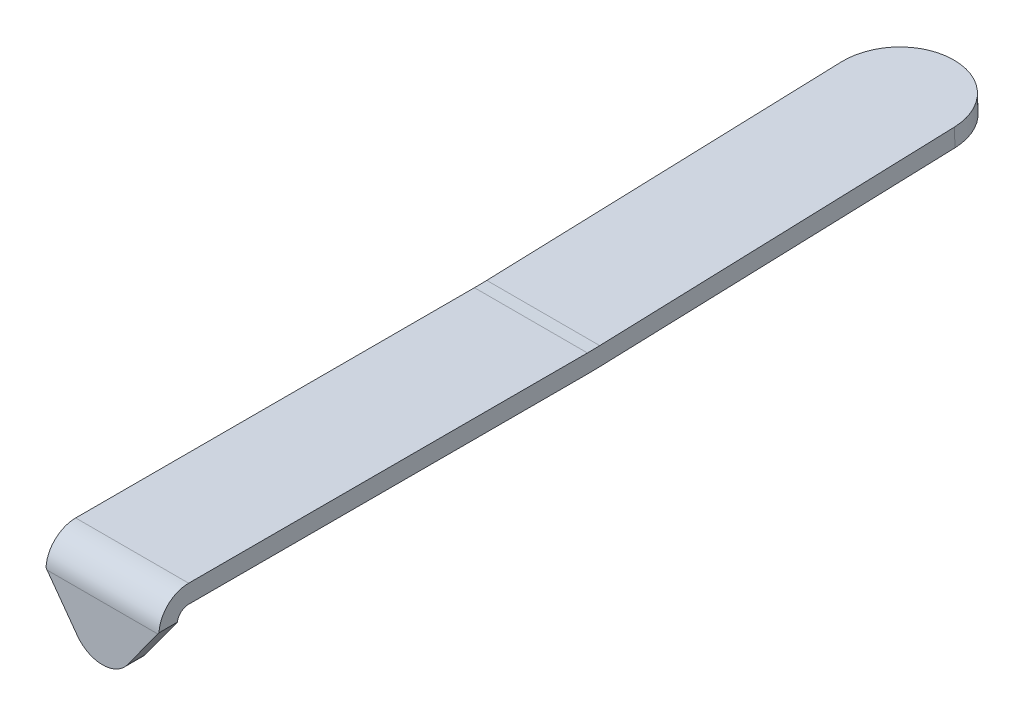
from build123d import *

# Parameters (mm, degrees)
EXTRUDE_3_DEPTH = 3.9243
EXTRUDE_2_DEPTH = 1.27
FILLET_1_R      = 0.79375
FILLET_3_R      = 2.06375
FILLET_4_R      = 3.8862


with BuildPart() as part:
    # Sketch 1 → Extrude 3 (new, symmetric)
    with BuildSketch(Plane(origin=(0, 0, 0), x_dir=(0, 1, 0), z_dir=(-1, 0, 0))):
        with BuildLine():
            Line((0, 0), (0, 29.765625))
            ThreePointArc((0, 29.765625), (0.003770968, 30.214099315), (0.015082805, 30.662446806))
            Line((0.015082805, 30.662446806), (0.974641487, 59.182))
            Line((0.974641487, 59.182), (2.243923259, 59.1392942))
            Line((2.243923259, 59.1392942), (1.284364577, 30.619741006))
            ThreePointArc((1.284364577, 30.619741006), (1.273591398, 30.192743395), (1.27, 29.765625))
            Line((1.27, 29.765625), (1.27, 0))
            Line((1.27, 0), (0, 0))
        make_face()
    extrude(amount=EXTRUDE_3_DEPTH, both=True)

    # Sketch 2 → Extrude 2 (add)
    with BuildSketch(Plane.XY):
        with BuildLine():
            Line((-1.746667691, -3.68202836), (-3.9243, -0.68477462))
            Line((-3.9243, -0.68477462), (-3.9243, 1.27))
            Line((-3.9243, 1.27), (3.9243, 1.27))
            Line((3.9243, 1.27), (3.9243, -0.68477462))
            Line((3.9243, -0.68477462), (1.746667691, -3.68202836))
            ThreePointArc((1.746667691, -3.68202836), (0, -4.572), (-1.746667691, -3.68202836))
        make_face()
    extrude(amount=-EXTRUDE_2_DEPTH)

    # Fillet 1
    fillet_1_edges = [part.edges().sort_by_distance(p)[0] for p in [
        (0, 0, -1.27),
    ]]
    fillet(fillet_1_edges, radius=FILLET_1_R)

    # Fillet 3
    fillet_3_edges = [part.edges().sort_by_distance(p)[0] for p in [
        (0, 1.27, 0),
    ]]
    fillet(fillet_3_edges, radius=FILLET_3_R)

    # Fillet 4
    fillet_4_edges = [part.edges().sort_by_distance(p)[0] for p in [
        (-3.9243, 1.609282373, -59.1606471),
        (3.9243, 1.609282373, -59.1606471),
    ]]
    fillet(fillet_4_edges, radius=FILLET_4_R)


solid = part.part
